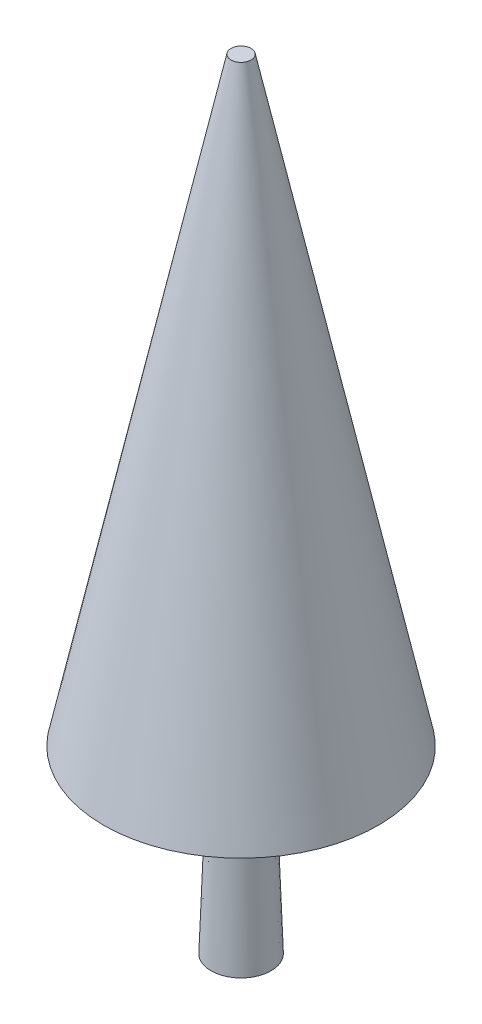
from build123d import *

# Parameters (mm, degrees)
ESQUISSE1_R        = 500
BOSS_EXTRU_1_DEPTH = 3000
BOSS_EXTRU_1_TAPER = 2
ESQUISSE2_R        = 2293.114029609
BOSS_EXTRU_2_DEPTH = 10000
BOSS_EXTRU_2_TAPER = 12


with BuildPart() as part:
    # Esquisse1 → Boss.-Extru.1 (new body)
    with BuildSketch(Plane(origin=(0, 0, 0), x_dir=(1, 0, 0), z_dir=(0, 1, 0))):
        Circle(ESQUISSE1_R)
    extrude(amount=BOSS_EXTRU_1_DEPTH, taper=BOSS_EXTRU_1_TAPER)

    # Esquisse2 → Boss.-Extru.2 (add)
    with BuildSketch(Plane(origin=(0, 3000, 0), x_dir=(1, 0, 0), z_dir=(0, 1, 0))):
        Circle(ESQUISSE2_R)
    extrude(amount=BOSS_EXTRU_2_DEPTH, taper=BOSS_EXTRU_2_TAPER)


solid = part.part
